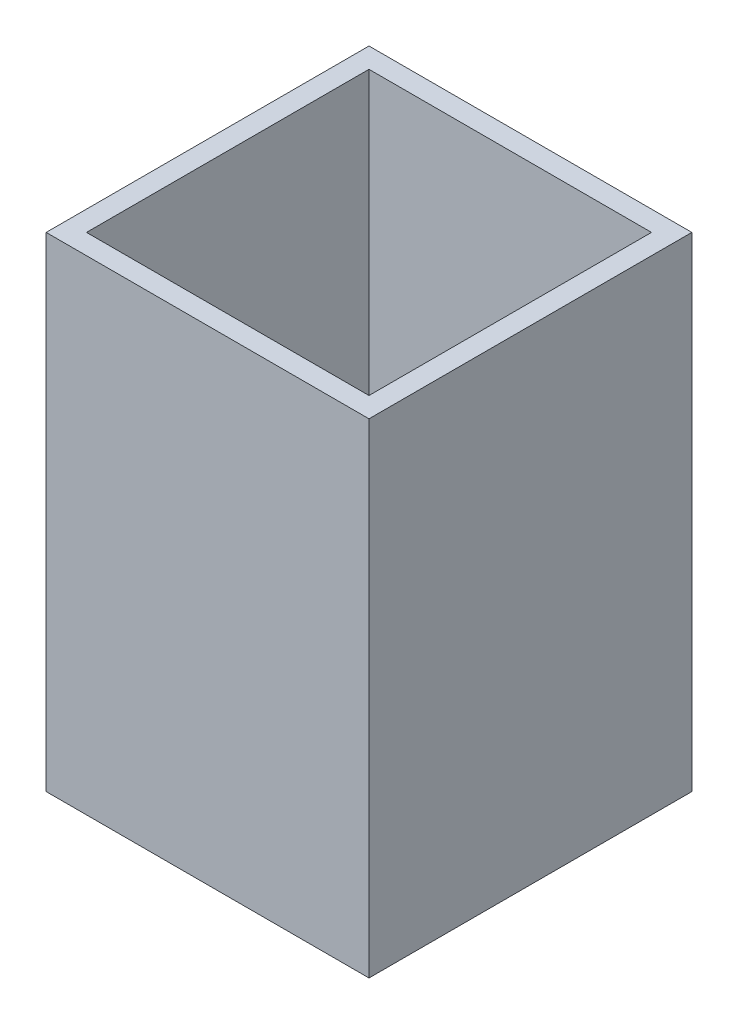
ISO-10303-21;
HEADER;
FILE_DESCRIPTION(('STEP AP214'),'2;1');
FILE_NAME('part.step','',(''),(''),'','','');
FILE_SCHEMA(('AUTOMOTIVE_DESIGN { 1 0 10303 214 1 1 1 1 }'));
ENDSEC;
DATA;
#1=APPLICATION_CONTEXT('core data for automotive mechanical design processes');
#2=APPLICATION_PROTOCOL_DEFINITION('international standard','automotive_design',2000,#1);
#3=PRODUCT_CONTEXT('',#1,'mechanical');
#4=PRODUCT('Part','Part','',(#3));
#5=PRODUCT_RELATED_PRODUCT_CATEGORY('part','',(#4));
#6=PRODUCT_DEFINITION_FORMATION('','',#4);
#7=PRODUCT_DEFINITION_CONTEXT('part definition',#1,'design');
#8=PRODUCT_DEFINITION('design','',#6,#7);
#9=PRODUCT_DEFINITION_SHAPE('','',#8);
#10=(LENGTH_UNIT() NAMED_UNIT(*) SI_UNIT(.MILLI.,.METRE.));
#11=(NAMED_UNIT(*) PLANE_ANGLE_UNIT() SI_UNIT($,.RADIAN.));
#12=(NAMED_UNIT(*) SI_UNIT($,.STERADIAN.) SOLID_ANGLE_UNIT());
#13=UNCERTAINTY_MEASURE_WITH_UNIT(LENGTH_MEASURE(1.E-05),#10,'distance_accuracy_value','');
#14=(GEOMETRIC_REPRESENTATION_CONTEXT(3) GLOBAL_UNCERTAINTY_ASSIGNED_CONTEXT((#13)) GLOBAL_UNIT_ASSIGNED_CONTEXT((#10,
#11,#12)) REPRESENTATION_CONTEXT('',''));
#15=CARTESIAN_POINT('',(0.,0.,0.));
#16=DIRECTION('',(0.,0.,1.));
#17=DIRECTION('',(1.,0.,0.));
#18=AXIS2_PLACEMENT_3D('',#15,#16,#17);
#19=CARTESIAN_POINT('',(39.5275482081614,0.,23.5625298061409));
#20=DIRECTION('',(0.,0.,1.));
#21=DIRECTION('',(1.,0.,0.));
#22=AXIS2_PLACEMENT_3D('',#19,#20,#21);
#23=PLANE('',#22);
#24=DIRECTION('',(1.,0.,0.));
#25=VECTOR('',#24,1.);
#26=CARTESIAN_POINT('',(39.5275482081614,76.2,23.5625298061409));
#27=LINE('',#26,#25);
#28=CARTESIAN_POINT('',(39.5275482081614,76.2,23.5625298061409));
#29=VERTEX_POINT('',#28);
#30=CARTESIAN_POINT('',(90.3275482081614,76.2,23.5625298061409));
#31=VERTEX_POINT('',#30);
#32=EDGE_CURVE('E129',#29,#31,#27,.T.);
#33=ORIENTED_EDGE('',*,*,#32,.F.);
#34=DIRECTION('',(0.,1.,0.));
#35=VECTOR('',#34,1.);
#36=CARTESIAN_POINT('',(39.5275482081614,0.,23.5625298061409));
#37=LINE('',#36,#35);
#38=CARTESIAN_POINT('',(39.5275482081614,0.,23.5625298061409));
#39=VERTEX_POINT('',#38);
#40=EDGE_CURVE('E11',#39,#29,#37,.T.);
#41=ORIENTED_EDGE('',*,*,#40,.F.);
#42=DIRECTION('',(1.,0.,0.));
#43=VECTOR('',#42,1.);
#44=CARTESIAN_POINT('',(39.5275482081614,0.,23.5625298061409));
#45=LINE('',#44,#43);
#46=CARTESIAN_POINT('',(90.3275482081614,0.,23.5625298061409));
#47=VERTEX_POINT('',#46);
#48=EDGE_CURVE('E133',#39,#47,#45,.T.);
#49=ORIENTED_EDGE('',*,*,#48,.T.);
#50=DIRECTION('',(0.,1.,0.));
#51=VECTOR('',#50,1.);
#52=CARTESIAN_POINT('',(90.3275482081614,0.,23.5625298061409));
#53=LINE('',#52,#51);
#54=EDGE_CURVE('E34',#47,#31,#53,.T.);
#55=ORIENTED_EDGE('',*,*,#54,.T.);
#56=EDGE_LOOP('',(#33,#41,#49,#55));
#57=FACE_BOUND('',#56,.T.);
#58=ADVANCED_FACE('F31',(#57),#23,.T.);
#59=CARTESIAN_POINT('',(39.5275482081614,0.,-27.2374701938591));
#60=DIRECTION('',(-1.,0.,0.));
#61=DIRECTION('',(0.,0.,1.));
#62=AXIS2_PLACEMENT_3D('',#59,#60,#61);
#63=PLANE('',#62);
#64=DIRECTION('',(0.,0.,1.));
#65=VECTOR('',#64,1.);
#66=CARTESIAN_POINT('',(39.5275482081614,76.2,-27.2374701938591));
#67=LINE('',#66,#65);
#68=CARTESIAN_POINT('',(39.5275482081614,76.2,-27.2374701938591));
#69=VERTEX_POINT('',#68);
#70=EDGE_CURVE('E137',#69,#29,#67,.T.);
#71=ORIENTED_EDGE('',*,*,#70,.F.);
#72=DIRECTION('',(0.,1.,0.));
#73=VECTOR('',#72,1.);
#74=CARTESIAN_POINT('',(39.5275482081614,0.,-27.2374701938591));
#75=LINE('',#74,#73);
#76=CARTESIAN_POINT('',(39.5275482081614,0.,-27.2374701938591));
#77=VERTEX_POINT('',#76);
#78=EDGE_CURVE('E39',#77,#69,#75,.T.);
#79=ORIENTED_EDGE('',*,*,#78,.F.);
#80=DIRECTION('',(0.,0.,1.));
#81=VECTOR('',#80,1.);
#82=CARTESIAN_POINT('',(39.5275482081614,0.,-27.2374701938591));
#83=LINE('',#82,#81);
#84=EDGE_CURVE('E143',#77,#39,#83,.T.);
#85=ORIENTED_EDGE('',*,*,#84,.T.);
#86=ORIENTED_EDGE('',*,*,#40,.T.);
#87=EDGE_LOOP('',(#71,#79,#85,#86));
#88=FACE_BOUND('',#87,.T.);
#89=ADVANCED_FACE('F169',(#88),#63,.T.);
#90=CARTESIAN_POINT('',(90.3275482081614,0.,-27.2374701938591));
#91=DIRECTION('',(0.,0.,-1.));
#92=DIRECTION('',(-1.,0.,0.));
#93=AXIS2_PLACEMENT_3D('',#90,#91,#92);
#94=PLANE('',#93);
#95=DIRECTION('',(-1.,0.,0.));
#96=VECTOR('',#95,1.);
#97=CARTESIAN_POINT('',(90.3275482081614,76.2,-27.2374701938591));
#98=LINE('',#97,#96);
#99=CARTESIAN_POINT('',(90.3275482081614,76.2,-27.2374701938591));
#100=VERTEX_POINT('',#99);
#101=EDGE_CURVE('E151',#100,#69,#98,.T.);
#102=ORIENTED_EDGE('',*,*,#101,.F.);
#103=DIRECTION('',(0.,1.,0.));
#104=VECTOR('',#103,1.);
#105=CARTESIAN_POINT('',(90.3275482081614,0.,-27.2374701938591));
#106=LINE('',#105,#104);
#107=CARTESIAN_POINT('',(90.3275482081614,0.,-27.2374701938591));
#108=VERTEX_POINT('',#107);
#109=EDGE_CURVE('E156',#108,#100,#106,.T.);
#110=ORIENTED_EDGE('',*,*,#109,.F.);
#111=DIRECTION('',(-1.,0.,0.));
#112=VECTOR('',#111,1.);
#113=CARTESIAN_POINT('',(90.3275482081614,0.,-27.2374701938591));
#114=LINE('',#113,#112);
#115=EDGE_CURVE('E140',#108,#77,#114,.T.);
#116=ORIENTED_EDGE('',*,*,#115,.T.);
#117=ORIENTED_EDGE('',*,*,#78,.T.);
#118=EDGE_LOOP('',(#102,#110,#116,#117));
#119=FACE_BOUND('',#118,.T.);
#120=ADVANCED_FACE('F173',(#119),#94,.T.);
#121=CARTESIAN_POINT('',(90.3275482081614,0.,23.5625298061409));
#122=DIRECTION('',(1.,0.,0.));
#123=DIRECTION('',(0.,0.,-1.));
#124=AXIS2_PLACEMENT_3D('',#121,#122,#123);
#125=PLANE('',#124);
#126=DIRECTION('',(0.,0.,-1.));
#127=VECTOR('',#126,1.);
#128=CARTESIAN_POINT('',(90.3275482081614,76.2,23.5625298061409));
#129=LINE('',#128,#127);
#130=EDGE_CURVE('E148',#31,#100,#129,.T.);
#131=ORIENTED_EDGE('',*,*,#130,.F.);
#132=ORIENTED_EDGE('',*,*,#54,.F.);
#133=DIRECTION('',(0.,0.,-1.));
#134=VECTOR('',#133,1.);
#135=CARTESIAN_POINT('',(90.3275482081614,0.,23.5625298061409));
#136=LINE('',#135,#134);
#137=EDGE_CURVE('E136',#47,#108,#136,.T.);
#138=ORIENTED_EDGE('',*,*,#137,.T.);
#139=ORIENTED_EDGE('',*,*,#109,.T.);
#140=EDGE_LOOP('',(#131,#132,#138,#139));
#141=FACE_BOUND('',#140,.T.);
#142=ADVANCED_FACE('F164',(#141),#125,.T.);
#143=CARTESIAN_POINT('',(90.3275482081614,0.,23.5625298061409));
#144=DIRECTION('',(0.,1.,0.));
#145=DIRECTION('',(0.,0.,1.));
#146=AXIS2_PLACEMENT_3D('',#143,#144,#145);
#147=PLANE('',#146);
#148=DIRECTION('',(0.,0.,-1.));
#149=VECTOR('',#148,1.);
#150=CARTESIAN_POINT('',(87.1525482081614,0.,-24.0624701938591));
#151=LINE('',#150,#149);
#152=CARTESIAN_POINT('',(87.1525482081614,0.,20.3875298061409));
#153=VERTEX_POINT('',#152);
#154=CARTESIAN_POINT('',(87.1525482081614,0.,-24.0624701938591));
#155=VERTEX_POINT('',#154);
#156=EDGE_CURVE('E104',#153,#155,#151,.T.);
#157=ORIENTED_EDGE('',*,*,#156,.T.);
#158=DIRECTION('',(-1.,0.,0.));
#159=VECTOR('',#158,1.);
#160=CARTESIAN_POINT('',(42.7025482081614,0.,-24.0624701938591));
#161=LINE('',#160,#159);
#162=CARTESIAN_POINT('',(42.7025482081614,0.,-24.0624701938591));
#163=VERTEX_POINT('',#162);
#164=EDGE_CURVE('E98',#155,#163,#161,.T.);
#165=ORIENTED_EDGE('',*,*,#164,.T.);
#166=DIRECTION('',(0.,0.,1.));
#167=VECTOR('',#166,1.);
#168=CARTESIAN_POINT('',(42.7025482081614,0.,20.3875298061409));
#169=LINE('',#168,#167);
#170=CARTESIAN_POINT('',(42.7025482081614,0.,20.3875298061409));
#171=VERTEX_POINT('',#170);
#172=EDGE_CURVE('E107',#163,#171,#169,.T.);
#173=ORIENTED_EDGE('',*,*,#172,.T.);
#174=DIRECTION('',(1.,0.,0.));
#175=VECTOR('',#174,1.);
#176=CARTESIAN_POINT('',(87.1525482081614,0.,20.3875298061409));
#177=LINE('',#176,#175);
#178=EDGE_CURVE('E47',#171,#153,#177,.T.);
#179=ORIENTED_EDGE('',*,*,#178,.T.);
#180=EDGE_LOOP('',(#157,#165,#173,#179));
#181=FACE_BOUND('',#180,.T.);
#182=ORIENTED_EDGE('',*,*,#48,.F.);
#183=ORIENTED_EDGE('',*,*,#84,.F.);
#184=ORIENTED_EDGE('',*,*,#115,.F.);
#185=ORIENTED_EDGE('',*,*,#137,.F.);
#186=EDGE_LOOP('',(#182,#183,#184,#185));
#187=FACE_BOUND('',#186,.T.);
#188=ADVANCED_FACE('F111',(#181,#187),#147,.F.);
#189=CARTESIAN_POINT('',(90.3275482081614,76.2,23.5625298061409));
#190=DIRECTION('',(0.,1.,0.));
#191=DIRECTION('',(0.,0.,1.));
#192=AXIS2_PLACEMENT_3D('',#189,#190,#191);
#193=PLANE('',#192);
#194=DIRECTION('',(-1.,0.,0.));
#195=VECTOR('',#194,1.);
#196=CARTESIAN_POINT('',(42.7025482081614,76.2,-24.0624701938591));
#197=LINE('',#196,#195);
#198=CARTESIAN_POINT('',(87.1525482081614,76.2,-24.0624701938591));
#199=VERTEX_POINT('',#198);
#200=CARTESIAN_POINT('',(42.7025482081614,76.2,-24.0624701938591));
#201=VERTEX_POINT('',#200);
#202=EDGE_CURVE('E55',#199,#201,#197,.T.);
#203=ORIENTED_EDGE('',*,*,#202,.F.);
#204=DIRECTION('',(0.,0.,-1.));
#205=VECTOR('',#204,1.);
#206=CARTESIAN_POINT('',(87.1525482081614,76.2,-24.0624701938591));
#207=LINE('',#206,#205);
#208=CARTESIAN_POINT('',(87.1525482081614,76.2,20.3875298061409));
#209=VERTEX_POINT('',#208);
#210=EDGE_CURVE('E114',#209,#199,#207,.T.);
#211=ORIENTED_EDGE('',*,*,#210,.F.);
#212=DIRECTION('',(1.,0.,0.));
#213=VECTOR('',#212,1.);
#214=CARTESIAN_POINT('',(87.1525482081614,76.2,20.3875298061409));
#215=LINE('',#214,#213);
#216=CARTESIAN_POINT('',(42.7025482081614,76.2,20.3875298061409));
#217=VERTEX_POINT('',#216);
#218=EDGE_CURVE('E117',#217,#209,#215,.T.);
#219=ORIENTED_EDGE('',*,*,#218,.F.);
#220=DIRECTION('',(0.,0.,1.));
#221=VECTOR('',#220,1.);
#222=CARTESIAN_POINT('',(42.7025482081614,76.2,20.3875298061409));
#223=LINE('',#222,#221);
#224=EDGE_CURVE('E123',#201,#217,#223,.T.);
#225=ORIENTED_EDGE('',*,*,#224,.F.);
#226=EDGE_LOOP('',(#203,#211,#219,#225));
#227=FACE_BOUND('',#226,.T.);
#228=ORIENTED_EDGE('',*,*,#32,.T.);
#229=ORIENTED_EDGE('',*,*,#130,.T.);
#230=ORIENTED_EDGE('',*,*,#101,.T.);
#231=ORIENTED_EDGE('',*,*,#70,.T.);
#232=EDGE_LOOP('',(#228,#229,#230,#231));
#233=FACE_BOUND('',#232,.T.);
#234=ADVANCED_FACE('F166',(#227,#233),#193,.T.);
#235=CARTESIAN_POINT('',(42.7025482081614,0.,-24.0624701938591));
#236=DIRECTION('',(0.,0.,-1.));
#237=DIRECTION('',(-1.,0.,0.));
#238=AXIS2_PLACEMENT_3D('',#235,#236,#237);
#239=PLANE('',#238);
#240=ORIENTED_EDGE('',*,*,#202,.T.);
#241=DIRECTION('',(0.,1.,0.));
#242=VECTOR('',#241,1.);
#243=CARTESIAN_POINT('',(42.7025482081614,0.,-24.0624701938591));
#244=LINE('',#243,#242);
#245=EDGE_CURVE('E94',#163,#201,#244,.T.);
#246=ORIENTED_EDGE('',*,*,#245,.F.);
#247=ORIENTED_EDGE('',*,*,#164,.F.);
#248=DIRECTION('',(0.,1.,0.));
#249=VECTOR('',#248,1.);
#250=CARTESIAN_POINT('',(87.1525482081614,0.,-24.0624701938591));
#251=LINE('',#250,#249);
#252=EDGE_CURVE('E127',#155,#199,#251,.T.);
#253=ORIENTED_EDGE('',*,*,#252,.T.);
#254=EDGE_LOOP('',(#240,#246,#247,#253));
#255=FACE_BOUND('',#254,.T.);
#256=ADVANCED_FACE('F96',(#255),#239,.F.);
#257=CARTESIAN_POINT('',(87.1525482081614,0.,-24.0624701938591));
#258=DIRECTION('',(1.,0.,0.));
#259=DIRECTION('',(0.,0.,-1.));
#260=AXIS2_PLACEMENT_3D('',#257,#258,#259);
#261=PLANE('',#260);
#262=ORIENTED_EDGE('',*,*,#210,.T.);
#263=ORIENTED_EDGE('',*,*,#252,.F.);
#264=ORIENTED_EDGE('',*,*,#156,.F.);
#265=DIRECTION('',(0.,1.,0.));
#266=VECTOR('',#265,1.);
#267=CARTESIAN_POINT('',(87.1525482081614,0.,20.3875298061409));
#268=LINE('',#267,#266);
#269=EDGE_CURVE('E130',#153,#209,#268,.T.);
#270=ORIENTED_EDGE('',*,*,#269,.T.);
#271=EDGE_LOOP('',(#262,#263,#264,#270));
#272=FACE_BOUND('',#271,.T.);
#273=ADVANCED_FACE('F224',(#272),#261,.F.);
#274=CARTESIAN_POINT('',(87.1525482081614,0.,20.3875298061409));
#275=DIRECTION('',(0.,0.,1.));
#276=DIRECTION('',(1.,0.,0.));
#277=AXIS2_PLACEMENT_3D('',#274,#275,#276);
#278=PLANE('',#277);
#279=ORIENTED_EDGE('',*,*,#218,.T.);
#280=ORIENTED_EDGE('',*,*,#269,.F.);
#281=ORIENTED_EDGE('',*,*,#178,.F.);
#282=DIRECTION('',(0.,1.,0.));
#283=VECTOR('',#282,1.);
#284=CARTESIAN_POINT('',(42.7025482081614,0.,20.3875298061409));
#285=LINE('',#284,#283);
#286=EDGE_CURVE('E103',#171,#217,#285,.T.);
#287=ORIENTED_EDGE('',*,*,#286,.T.);
#288=EDGE_LOOP('',(#279,#280,#281,#287));
#289=FACE_BOUND('',#288,.T.);
#290=ADVANCED_FACE('F233',(#289),#278,.F.);
#291=CARTESIAN_POINT('',(42.7025482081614,0.,20.3875298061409));
#292=DIRECTION('',(-1.,0.,0.));
#293=DIRECTION('',(0.,0.,1.));
#294=AXIS2_PLACEMENT_3D('',#291,#292,#293);
#295=PLANE('',#294);
#296=ORIENTED_EDGE('',*,*,#224,.T.);
#297=ORIENTED_EDGE('',*,*,#286,.F.);
#298=ORIENTED_EDGE('',*,*,#172,.F.);
#299=ORIENTED_EDGE('',*,*,#245,.T.);
#300=EDGE_LOOP('',(#296,#297,#298,#299));
#301=FACE_BOUND('',#300,.T.);
#302=ADVANCED_FACE('F108',(#301),#295,.F.);
#303=CLOSED_SHELL('',(#58,#89,#120,#142,#188,#234,#256,#273,#290,#302));
#304=MANIFOLD_SOLID_BREP('B2',#303);
#305=ADVANCED_BREP_SHAPE_REPRESENTATION('',(#18,#304),#14);
#306=SHAPE_DEFINITION_REPRESENTATION(#9,#305);
ENDSEC;
END-ISO-10303-21;
